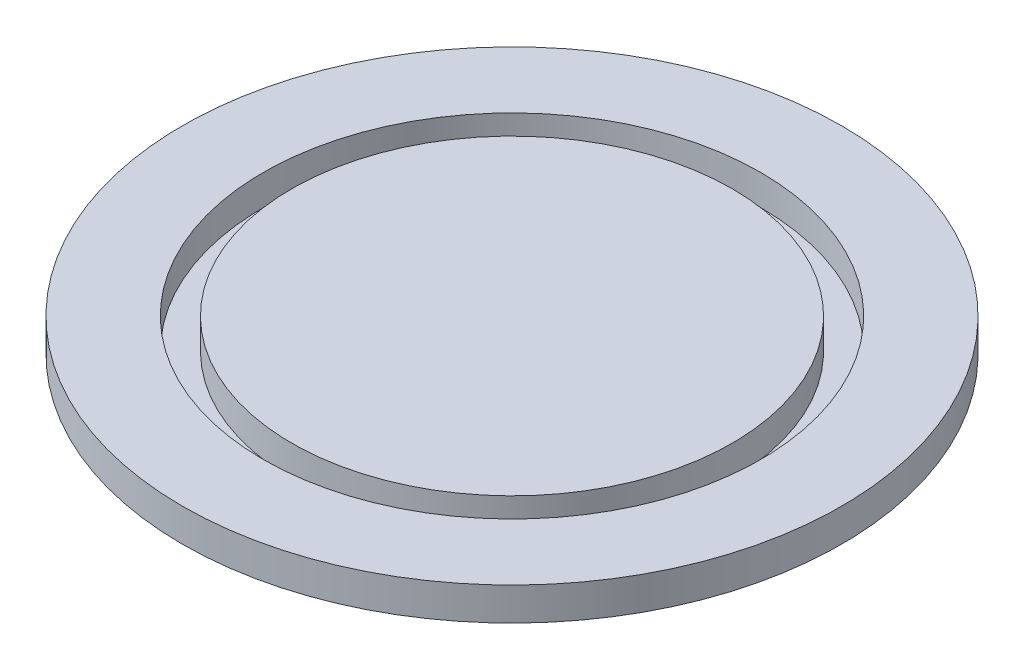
ISO-10303-21;
HEADER;
FILE_DESCRIPTION(('STEP AP214'),'2;1');
FILE_NAME('part.step','',(''),(''),'','','');
FILE_SCHEMA(('AUTOMOTIVE_DESIGN { 1 0 10303 214 1 1 1 1 }'));
ENDSEC;
DATA;
#1=APPLICATION_CONTEXT('core data for automotive mechanical design processes');
#2=APPLICATION_PROTOCOL_DEFINITION('international standard','automotive_design',2000,#1);
#3=PRODUCT_CONTEXT('',#1,'mechanical');
#4=PRODUCT('Part','Part','',(#3));
#5=PRODUCT_RELATED_PRODUCT_CATEGORY('part','',(#4));
#6=PRODUCT_DEFINITION_FORMATION('','',#4);
#7=PRODUCT_DEFINITION_CONTEXT('part definition',#1,'design');
#8=PRODUCT_DEFINITION('design','',#6,#7);
#9=PRODUCT_DEFINITION_SHAPE('','',#8);
#10=(LENGTH_UNIT() NAMED_UNIT(*) SI_UNIT(.MILLI.,.METRE.));
#11=(NAMED_UNIT(*) PLANE_ANGLE_UNIT() SI_UNIT($,.RADIAN.));
#12=(NAMED_UNIT(*) SI_UNIT($,.STERADIAN.) SOLID_ANGLE_UNIT());
#13=UNCERTAINTY_MEASURE_WITH_UNIT(LENGTH_MEASURE(1.E-05),#10,'distance_accuracy_value','');
#14=(GEOMETRIC_REPRESENTATION_CONTEXT(3) GLOBAL_UNCERTAINTY_ASSIGNED_CONTEXT((#13)) GLOBAL_UNIT_ASSIGNED_CONTEXT((#10,
#11,#12)) REPRESENTATION_CONTEXT('',''));
#15=CARTESIAN_POINT('',(0.,0.,0.));
#16=DIRECTION('',(0.,0.,1.));
#17=DIRECTION('',(1.,0.,0.));
#18=AXIS2_PLACEMENT_3D('',#15,#16,#17);
#19=CARTESIAN_POINT('',(4.44089209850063E-13,5.08000000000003,-3.33066907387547E-13));
#20=DIRECTION('',(0.,1.,0.));
#21=DIRECTION('',(0.,0.,1.));
#22=AXIS2_PLACEMENT_3D('',#19,#20,#21);
#23=PLANE('',#22);
#24=CARTESIAN_POINT('',(4.44089209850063E-13,5.08000000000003,-3.33066907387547E-13));
#25=DIRECTION('',(0.,-1.,0.));
#26=DIRECTION('',(0.,0.,-1.));
#27=AXIS2_PLACEMENT_3D('',#24,#25,#26);
#28=CIRCLE('',#27,18.3388);
#29=CARTESIAN_POINT('',(4.49051998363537E-13,5.08000000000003,-18.3388000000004));
#30=VERTEX_POINT('',#29);
#31=EDGE_CURVE('E19',#30,#30,#28,.T.);
#32=ORIENTED_EDGE('',*,*,#31,.F.);
#33=EDGE_LOOP('',(#32));
#34=FACE_BOUND('',#33,.T.);
#35=ADVANCED_FACE('F16',(#34),#23,.T.);
#36=CARTESIAN_POINT('',(0.,0.,0.));
#37=DIRECTION('',(0.,-1.,0.));
#38=DIRECTION('',(0.,0.,-1.));
#39=AXIS2_PLACEMENT_3D('',#36,#37,#38);
#40=CYLINDRICAL_SURFACE('',#39,18.3388);
#41=ORIENTED_EDGE('',*,*,#31,.T.);
#42=EDGE_LOOP('',(#41));
#43=FACE_BOUND('',#42,.T.);
#44=CARTESIAN_POINT('',(2.22044604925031E-13,2.53999999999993,3.33066907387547E-13));
#45=DIRECTION('',(0.,-1.,0.));
#46=DIRECTION('',(0.,0.,-1.));
#47=AXIS2_PLACEMENT_3D('',#44,#45,#46);
#48=CIRCLE('',#47,18.3388);
#49=CARTESIAN_POINT('',(2.27007393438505E-13,2.53999999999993,-18.3387999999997));
#50=VERTEX_POINT('',#49);
#51=EDGE_CURVE('E38',#50,#50,#48,.T.);
#52=ORIENTED_EDGE('',*,*,#51,.F.);
#53=EDGE_LOOP('',(#52));
#54=FACE_BOUND('',#53,.T.);
#55=ADVANCED_FACE('F45',(#43,#54),#40,.T.);
#56=CARTESIAN_POINT('',(20.7010000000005,2.54000000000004,-3.33066907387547E-13));
#57=DIRECTION('',(0.,1.,0.));
#58=DIRECTION('',(0.,0.,1.));
#59=AXIS2_PLACEMENT_3D('',#56,#57,#58);
#60=PLANE('',#59);
#61=CARTESIAN_POINT('',(2.22044604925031E-13,2.53999999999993,3.33066907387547E-13));
#62=DIRECTION('',(0.,-1.,0.));
#63=DIRECTION('',(0.,0.,-1.));
#64=AXIS2_PLACEMENT_3D('',#61,#62,#63);
#65=CIRCLE('',#64,20.701);
#66=CARTESIAN_POINT('',(2.27646644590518E-13,2.53999999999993,-20.7009999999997));
#67=VERTEX_POINT('',#66);
#68=EDGE_CURVE('E36',#67,#67,#65,.F.);
#69=ORIENTED_EDGE('',*,*,#68,.T.);
#70=EDGE_LOOP('',(#69));
#71=FACE_BOUND('',#70,.T.);
#72=ORIENTED_EDGE('',*,*,#51,.T.);
#73=EDGE_LOOP('',(#72));
#74=FACE_BOUND('',#73,.T.);
#75=ADVANCED_FACE('F52',(#71,#74),#60,.T.);
#76=CARTESIAN_POINT('',(0.,0.,0.));
#77=DIRECTION('',(0.,-1.,0.));
#78=DIRECTION('',(0.,0.,-1.));
#79=AXIS2_PLACEMENT_3D('',#76,#77,#78);
#80=CYLINDRICAL_SURFACE('',#79,20.701);
#81=ORIENTED_EDGE('',*,*,#68,.F.);
#82=EDGE_LOOP('',(#81));
#83=FACE_BOUND('',#82,.T.);
#84=CARTESIAN_POINT('',(4.44089209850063E-13,5.08000000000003,-3.33066907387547E-13));
#85=DIRECTION('',(0.,-1.,0.));
#86=DIRECTION('',(0.,0.,-1.));
#87=AXIS2_PLACEMENT_3D('',#84,#85,#86);
#88=CIRCLE('',#87,20.701);
#89=CARTESIAN_POINT('',(4.49691249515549E-13,5.08000000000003,-20.7010000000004));
#90=VERTEX_POINT('',#89);
#91=EDGE_CURVE('E33',#90,#90,#88,.T.);
#92=ORIENTED_EDGE('',*,*,#91,.F.);
#93=EDGE_LOOP('',(#92));
#94=FACE_BOUND('',#93,.T.);
#95=ADVANCED_FACE('F70',(#83,#94),#80,.F.);
#96=CARTESIAN_POINT('',(20.7010000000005,5.07999999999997,-2.22044604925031E-13));
#97=DIRECTION('',(0.,1.,0.));
#98=DIRECTION('',(0.,0.,1.));
#99=AXIS2_PLACEMENT_3D('',#96,#97,#98);
#100=PLANE('',#99);
#101=CARTESIAN_POINT('',(4.44089209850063E-13,5.08000000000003,-3.33066907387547E-13));
#102=DIRECTION('',(0.,-1.,0.));
#103=DIRECTION('',(0.,0.,-1.));
#104=AXIS2_PLACEMENT_3D('',#101,#102,#103);
#105=CIRCLE('',#104,27.432);
#106=CARTESIAN_POINT('',(4.5151277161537E-13,5.08000000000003,-27.4320000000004));
#107=VERTEX_POINT('',#106);
#108=EDGE_CURVE('E28',#107,#107,#105,.T.);
#109=ORIENTED_EDGE('',*,*,#108,.F.);
#110=EDGE_LOOP('',(#109));
#111=FACE_BOUND('',#110,.T.);
#112=ORIENTED_EDGE('',*,*,#91,.T.);
#113=EDGE_LOOP('',(#112));
#114=FACE_BOUND('',#113,.T.);
#115=ADVANCED_FACE('F66',(#111,#114),#100,.T.);
#116=CARTESIAN_POINT('',(0.,0.,0.));
#117=DIRECTION('',(0.,-1.,0.));
#118=DIRECTION('',(0.,0.,-1.));
#119=AXIS2_PLACEMENT_3D('',#116,#117,#118);
#120=CYLINDRICAL_SURFACE('',#119,27.432);
#121=CARTESIAN_POINT('',(4.44089209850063E-13,2.33680000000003,-6.66133814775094E-13));
#122=DIRECTION('',(0.,1.,0.));
#123=DIRECTION('',(0.,0.,1.));
#124=AXIS2_PLACEMENT_3D('',#121,#122,#123);
#125=CIRCLE('',#124,27.432);
#126=CARTESIAN_POINT('',(4.39330516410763E-13,2.33680000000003,27.4319999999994));
#127=VERTEX_POINT('',#126);
#128=EDGE_CURVE('E23',#127,#127,#125,.F.);
#129=ORIENTED_EDGE('',*,*,#128,.F.);
#130=EDGE_LOOP('',(#129));
#131=FACE_BOUND('',#130,.T.);
#132=ORIENTED_EDGE('',*,*,#108,.T.);
#133=EDGE_LOOP('',(#132));
#134=FACE_BOUND('',#133,.T.);
#135=ADVANCED_FACE('F60',(#131,#134),#120,.T.);
#136=CARTESIAN_POINT('',(4.44089209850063E-13,2.33680000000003,-6.66133814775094E-13));
#137=DIRECTION('',(0.,1.,0.));
#138=DIRECTION('',(0.,0.,1.));
#139=AXIS2_PLACEMENT_3D('',#136,#137,#138);
#140=CONICAL_SURFACE('',#139,27.432,1.30899693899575);
#141=ORIENTED_EDGE('',*,*,#128,.T.);
#142=EDGE_LOOP('',(#141));
#143=FACE_BOUND('',#142,.T.);
#144=CARTESIAN_POINT('',(0.,0.,0.));
#145=DIRECTION('',(0.,1.,0.));
#146=DIRECTION('',(0.,0.,1.));
#147=AXIS2_PLACEMENT_3D('',#144,#145,#146);
#148=CIRCLE('',#147,18.7109436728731);
#149=CARTESIAN_POINT('',(0.,0.,18.7109436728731));
#150=VERTEX_POINT('',#149);
#151=EDGE_CURVE('E10',#150,#150,#148,.F.);
#152=ORIENTED_EDGE('',*,*,#151,.F.);
#153=EDGE_LOOP('',(#152));
#154=FACE_BOUND('',#153,.T.);
#155=ADVANCED_FACE('F55',(#143,#154),#140,.T.);
#156=CARTESIAN_POINT('',(18.7109436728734,1.11022302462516E-13,2.22044604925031E-13));
#157=DIRECTION('',(0.,-1.,0.));
#158=DIRECTION('',(0.,0.,-1.));
#159=AXIS2_PLACEMENT_3D('',#156,#157,#158);
#160=PLANE('',#159);
#161=ORIENTED_EDGE('',*,*,#151,.T.);
#162=EDGE_LOOP('',(#161));
#163=FACE_BOUND('',#162,.T.);
#164=ADVANCED_FACE('F53',(#163),#160,.T.);
#165=CLOSED_SHELL('',(#35,#55,#75,#95,#115,#135,#155,#164));
#166=MANIFOLD_SOLID_BREP('B1',#165);
#167=ADVANCED_BREP_SHAPE_REPRESENTATION('',(#18,#166),#14);
#168=SHAPE_DEFINITION_REPRESENTATION(#9,#167);
ENDSEC;
END-ISO-10303-21;
